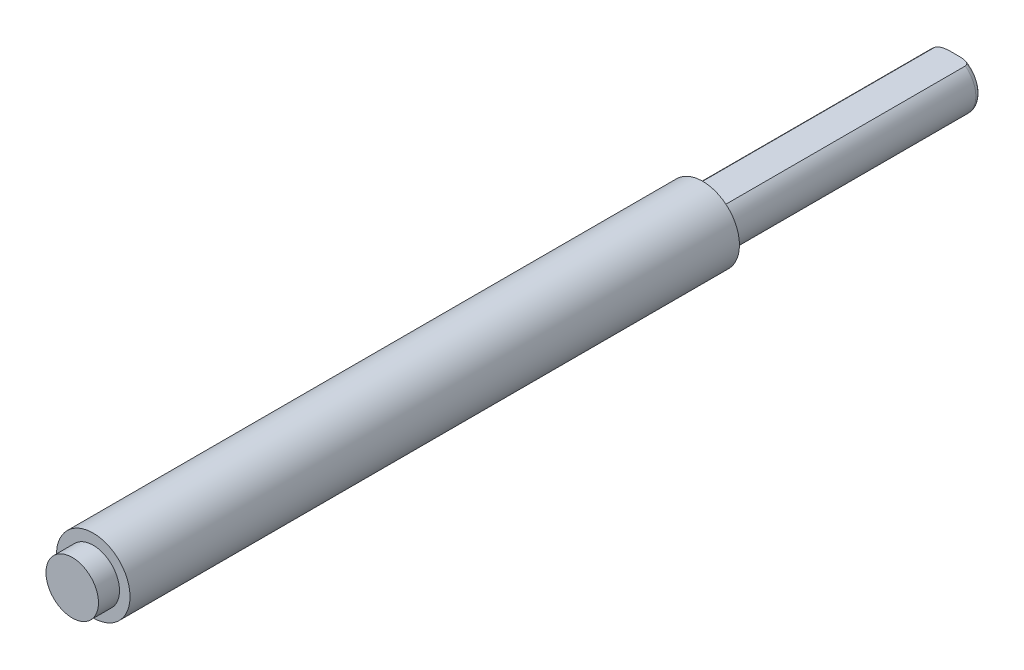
ISO-10303-21;
HEADER;
FILE_DESCRIPTION(('STEP AP214'),'2;1');
FILE_NAME('part.step','',(''),(''),'','','');
FILE_SCHEMA(('AUTOMOTIVE_DESIGN { 1 0 10303 214 1 1 1 1 }'));
ENDSEC;
DATA;
#1=APPLICATION_CONTEXT('core data for automotive mechanical design processes');
#2=APPLICATION_PROTOCOL_DEFINITION('international standard','automotive_design',2000,#1);
#3=PRODUCT_CONTEXT('',#1,'mechanical');
#4=PRODUCT('Part','Part','',(#3));
#5=PRODUCT_RELATED_PRODUCT_CATEGORY('part','',(#4));
#6=PRODUCT_DEFINITION_FORMATION('','',#4);
#7=PRODUCT_DEFINITION_CONTEXT('part definition',#1,'design');
#8=PRODUCT_DEFINITION('design','',#6,#7);
#9=PRODUCT_DEFINITION_SHAPE('','',#8);
#10=(LENGTH_UNIT() NAMED_UNIT(*) SI_UNIT(.MILLI.,.METRE.));
#11=(NAMED_UNIT(*) PLANE_ANGLE_UNIT() SI_UNIT($,.RADIAN.));
#12=(NAMED_UNIT(*) SI_UNIT($,.STERADIAN.) SOLID_ANGLE_UNIT());
#13=UNCERTAINTY_MEASURE_WITH_UNIT(LENGTH_MEASURE(1.E-05),#10,'distance_accuracy_value','');
#14=(GEOMETRIC_REPRESENTATION_CONTEXT(3) GLOBAL_UNCERTAINTY_ASSIGNED_CONTEXT((#13)) GLOBAL_UNIT_ASSIGNED_CONTEXT((#10,
#11,#12)) REPRESENTATION_CONTEXT('',''));
#15=CARTESIAN_POINT('',(0.,0.,0.));
#16=DIRECTION('',(0.,0.,1.));
#17=DIRECTION('',(1.,0.,0.));
#18=AXIS2_PLACEMENT_3D('',#15,#16,#17);
#19=CARTESIAN_POINT('',(0.,0.,82.));
#20=DIRECTION('',(0.,0.,1.));
#21=DIRECTION('',(1.,0.,0.));
#22=AXIS2_PLACEMENT_3D('',#19,#20,#21);
#23=PLANE('',#22);
#24=CARTESIAN_POINT('',(0.,0.,82.));
#25=DIRECTION('',(0.,0.,1.));
#26=DIRECTION('',(1.,0.,0.));
#27=AXIS2_PLACEMENT_3D('',#24,#25,#26);
#28=CIRCLE('',#27,3.5);
#29=CARTESIAN_POINT('',(3.5,0.,82.));
#30=VERTEX_POINT('',#29);
#31=EDGE_CURVE('E94',#30,#30,#28,.T.);
#32=ORIENTED_EDGE('',*,*,#31,.T.);
#33=EDGE_LOOP('',(#32));
#34=FACE_BOUND('',#33,.T.);
#35=CARTESIAN_POINT('',(0.,0.,82.));
#36=DIRECTION('',(0.,0.,1.));
#37=DIRECTION('',(1.,0.,0.));
#38=AXIS2_PLACEMENT_3D('',#35,#36,#37);
#39=CIRCLE('',#38,2.5);
#40=CARTESIAN_POINT('',(2.5,0.,82.));
#41=VERTEX_POINT('',#40);
#42=EDGE_CURVE('E158',#41,#41,#39,.T.);
#43=ORIENTED_EDGE('',*,*,#42,.F.);
#44=EDGE_LOOP('',(#43));
#45=FACE_BOUND('',#44,.T.);
#46=ADVANCED_FACE('F33',(#34,#45),#23,.T.);
#47=CARTESIAN_POINT('',(0.,0.,34.));
#48=DIRECTION('',(0.,0.,-1.));
#49=DIRECTION('',(-1.,0.,0.));
#50=AXIS2_PLACEMENT_3D('',#47,#48,#49);
#51=CYLINDRICAL_SURFACE('',#50,2.5);
#52=DIRECTION('',(0.,0.,-1.));
#53=VECTOR('',#52,1.);
#54=CARTESIAN_POINT('',(-1.5,2.,34.));
#55=LINE('',#54,#53);
#56=CARTESIAN_POINT('',(-1.5,2.,24.));
#57=VERTEX_POINT('',#56);
#58=CARTESIAN_POINT('',(-1.5,2.,0.5));
#59=VERTEX_POINT('',#58);
#60=EDGE_CURVE('E80',#57,#59,#55,.T.);
#61=ORIENTED_EDGE('',*,*,#60,.T.);
#62=CARTESIAN_POINT('',(0.,0.,0.5));
#63=DIRECTION('',(0.,0.,1.));
#64=DIRECTION('',(1.,0.,0.));
#65=AXIS2_PLACEMENT_3D('',#62,#63,#64);
#66=CIRCLE('',#65,2.5);
#67=CARTESIAN_POINT('',(1.5,2.,0.5));
#68=VERTEX_POINT('',#67);
#69=EDGE_CURVE('E103',#59,#68,#66,.T.);
#70=ORIENTED_EDGE('',*,*,#69,.T.);
#71=DIRECTION('',(0.,0.,-1.));
#72=VECTOR('',#71,1.);
#73=CARTESIAN_POINT('',(1.5,2.,34.));
#74=LINE('',#73,#72);
#75=CARTESIAN_POINT('',(1.5,2.,24.));
#76=VERTEX_POINT('',#75);
#77=EDGE_CURVE('E81',#76,#68,#74,.T.);
#78=ORIENTED_EDGE('',*,*,#77,.F.);
#79=CARTESIAN_POINT('',(0.,0.,24.));
#80=DIRECTION('',(0.,0.,1.));
#81=DIRECTION('',(1.,0.,0.));
#82=AXIS2_PLACEMENT_3D('',#79,#80,#81);
#83=CIRCLE('',#82,2.5);
#84=EDGE_CURVE('E101',#57,#76,#83,.T.);
#85=ORIENTED_EDGE('',*,*,#84,.F.);
#86=EDGE_LOOP('',(#61,#70,#78,#85));
#87=FACE_BOUND('',#86,.T.);
#88=ADVANCED_FACE('F124',(#87),#51,.T.);
#89=CARTESIAN_POINT('',(0.,0.,0.));
#90=DIRECTION('',(0.,0.,1.));
#91=DIRECTION('',(1.,0.,0.));
#92=AXIS2_PLACEMENT_3D('',#89,#90,#91);
#93=PLANE('',#92);
#94=CARTESIAN_POINT('',(0.,0.,0.));
#95=DIRECTION('',(0.,0.,1.));
#96=DIRECTION('',(1.,0.,0.));
#97=AXIS2_PLACEMENT_3D('',#94,#95,#96);
#98=CIRCLE('',#97,2.);
#99=CARTESIAN_POINT('',(0.,2.,0.));
#100=VERTEX_POINT('',#99);
#101=EDGE_CURVE('E11',#100,#100,#98,.F.);
#102=ORIENTED_EDGE('',*,*,#101,.T.);
#103=EDGE_LOOP('',(#102));
#104=FACE_BOUND('',#103,.T.);
#105=ADVANCED_FACE('F129',(#104),#93,.F.);
#106=CARTESIAN_POINT('',(0.,0.,24.));
#107=DIRECTION('',(0.,0.,1.));
#108=DIRECTION('',(1.,0.,0.));
#109=AXIS2_PLACEMENT_3D('',#106,#107,#108);
#110=PLANE('',#109);
#111=CARTESIAN_POINT('',(0.,0.,24.));
#112=DIRECTION('',(0.,0.,1.));
#113=DIRECTION('',(1.,0.,0.));
#114=AXIS2_PLACEMENT_3D('',#111,#112,#113);
#115=CIRCLE('',#114,3.5);
#116=CARTESIAN_POINT('',(3.5,0.,24.));
#117=VERTEX_POINT('',#116);
#118=EDGE_CURVE('E98',#117,#117,#115,.T.);
#119=ORIENTED_EDGE('',*,*,#118,.F.);
#120=EDGE_LOOP('',(#119));
#121=FACE_BOUND('',#120,.T.);
#122=EDGE_CURVE('E75',#76,#57,#83,.T.);
#123=ORIENTED_EDGE('',*,*,#122,.T.);
#124=ORIENTED_EDGE('',*,*,#84,.T.);
#125=EDGE_LOOP('',(#123,#124));
#126=FACE_BOUND('',#125,.T.);
#127=ADVANCED_FACE('F126',(#121,#126),#110,.F.);
#128=CARTESIAN_POINT('',(0.,0.,24.));
#129=DIRECTION('',(0.,0.,1.));
#130=DIRECTION('',(1.,0.,0.));
#131=AXIS2_PLACEMENT_3D('',#128,#129,#130);
#132=CYLINDRICAL_SURFACE('',#131,3.5);
#133=ORIENTED_EDGE('',*,*,#118,.T.);
#134=EDGE_LOOP('',(#133));
#135=FACE_BOUND('',#134,.T.);
#136=ORIENTED_EDGE('',*,*,#31,.F.);
#137=EDGE_LOOP('',(#136));
#138=FACE_BOUND('',#137,.T.);
#139=ADVANCED_FACE('F121',(#135,#138),#132,.T.);
#140=CARTESIAN_POINT('',(0.,0.,34.));
#141=DIRECTION('',(0.,0.,-1.));
#142=DIRECTION('',(-1.,0.,0.));
#143=AXIS2_PLACEMENT_3D('',#140,#141,#142);
#144=CYLINDRICAL_SURFACE('',#143,2.5);
#145=CARTESIAN_POINT('',(1.5,2.,34.));
#146=VERTEX_POINT('',#145);
#147=EDGE_CURVE('E69',#146,#76,#74,.T.);
#148=ORIENTED_EDGE('',*,*,#147,.F.);
#149=CARTESIAN_POINT('',(0.,0.,34.));
#150=DIRECTION('',(0.,0.,-1.));
#151=DIRECTION('',(-1.,0.,0.));
#152=AXIS2_PLACEMENT_3D('',#149,#150,#151);
#153=CIRCLE('',#152,2.5);
#154=CARTESIAN_POINT('',(-1.5,2.,34.));
#155=VERTEX_POINT('',#154);
#156=EDGE_CURVE('E72',#155,#146,#153,.T.);
#157=ORIENTED_EDGE('',*,*,#156,.F.);
#158=EDGE_CURVE('E90',#155,#57,#55,.T.);
#159=ORIENTED_EDGE('',*,*,#158,.T.);
#160=ORIENTED_EDGE('',*,*,#122,.F.);
#161=EDGE_LOOP('',(#148,#157,#159,#160));
#162=FACE_BOUND('',#161,.T.);
#163=ADVANCED_FACE('F71',(#162),#144,.F.);
#164=CARTESIAN_POINT('',(1.5,2.,34.));
#165=DIRECTION('',(0.,-1.,0.));
#166=DIRECTION('',(0.,0.,-1.));
#167=AXIS2_PLACEMENT_3D('',#164,#165,#166);
#168=PLANE('',#167);
#169=ORIENTED_EDGE('',*,*,#77,.T.);
#170=CARTESIAN_POINT('',(1.5,2.,0.5));
#171=CARTESIAN_POINT('',(1.50005508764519,2.,0.479993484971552));
#172=CARTESIAN_POINT('',(1.49800297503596,2.,0.460049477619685));
#173=CARTESIAN_POINT('',(1.49017103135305,2.,0.421109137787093));
#174=CARTESIAN_POINT('',(1.48442943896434,2.,0.402105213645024));
#175=CARTESIAN_POINT('',(1.46971395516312,2.,0.36549928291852));
#176=CARTESIAN_POINT('',(1.46075157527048,2.,0.347892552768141));
#177=CARTESIAN_POINT('',(1.44018960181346,2.,0.314258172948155));
#178=CARTESIAN_POINT('',(1.42858295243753,2.,0.298234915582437));
#179=CARTESIAN_POINT('',(1.39760924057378,2.,0.261066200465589));
#180=CARTESIAN_POINT('',(1.37710380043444,2.,0.240872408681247));
#181=CARTESIAN_POINT('',(1.3332153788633,2.,0.20398062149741));
#182=CARTESIAN_POINT('',(1.30982929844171,2.,0.187286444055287));
#183=CARTESIAN_POINT('',(1.24588475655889,2.,0.147473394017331));
#184=CARTESIAN_POINT('',(1.20375339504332,2.,0.126889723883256));
#185=CARTESIAN_POINT('',(1.13857481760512,2.,0.100734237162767));
#186=CARTESIAN_POINT('',(1.11639476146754,2.,0.092772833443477));
#187=CARTESIAN_POINT('',(1.07158652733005,2.,0.0782652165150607));
#188=CARTESIAN_POINT('',(1.04895868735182,2.,0.071717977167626));
#189=CARTESIAN_POINT('',(0.982989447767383,2.,0.0545224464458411));
#190=CARTESIAN_POINT('',(0.939240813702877,2.,0.0454505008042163));
#191=CARTESIAN_POINT('',(0.851180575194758,2.,0.0305610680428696));
#192=CARTESIAN_POINT('',(0.806868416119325,2.,0.0247470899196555));
#193=CARTESIAN_POINT('',(0.717748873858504,2.,0.0154595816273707));
#194=CARTESIAN_POINT('',(0.672940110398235,2.,0.0119999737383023));
#195=CARTESIAN_POINT('',(0.583224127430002,2.,0.00672393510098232));
#196=CARTESIAN_POINT('',(0.538316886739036,2.,0.0049079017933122));
#197=CARTESIAN_POINT('',(0.452027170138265,2.,0.00241155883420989));
#198=CARTESIAN_POINT('',(0.410646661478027,2.,0.00165282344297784));
#199=CARTESIAN_POINT('',(0.327877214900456,2.,0.000635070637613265));
#200=CARTESIAN_POINT('',(0.286488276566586,2.,0.000376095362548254));
#201=CARTESIAN_POINT('',(0.204245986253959,2.,7.37240462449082E-05));
#202=CARTESIAN_POINT('',(0.163392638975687,2.,2.7579873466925E-05));
#203=CARTESIAN_POINT('',(0.0816928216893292,2.,5.54583589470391E-07));
#204=CARTESIAN_POINT('',(0.0408463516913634,2.,1.96623861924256E-05));
#205=CARTESIAN_POINT('',(0.,2.,0.));
#206=B_SPLINE_CURVE_WITH_KNOTS('',3,(#170,#171,#172,#173,#174,#175,#176,#177,#178,#179,#180,
#181,#182,#183,#184,#185,#186,#187,#188,#189,#190,#191,#192,#193,#194,#195,#196,#197,#198,#199,
#200,#201,#202,#203,#204,#205),.UNSPECIFIED.,.F.,.F.,(4,2,2,2,2,2,2,2,2,2,2,2,2,2,2,2,2,4),(0.,
0.0598154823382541,0.119020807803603,0.178016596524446,0.237171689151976,0.32302240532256,
0.4089662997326,0.548800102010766,0.619474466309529,0.690097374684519,0.823948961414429,
0.957944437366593,1.09272554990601,1.2275392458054,1.35169671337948,1.47586464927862,
1.59842472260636,1.72096398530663),.UNSPECIFIED.);
#207=EDGE_CURVE('E42',#68,#100,#206,.T.);
#208=ORIENTED_EDGE('',*,*,#207,.T.);
#209=CARTESIAN_POINT('',(0.,2.,0.));
#210=CARTESIAN_POINT('',(-0.0407626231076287,2.,1.95157159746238E-05));
#211=CARTESIAN_POINT('',(-0.0815253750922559,2.,5.56610073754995E-07));
#212=CARTESIAN_POINT('',(-0.16305752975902,2.,2.73480300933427E-05));
#213=CARTESIAN_POINT('',(-0.203826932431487,2.,7.31092075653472E-05));
#214=CARTESIAN_POINT('',(-0.285823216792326,2.,0.000372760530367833));
#215=CARTESIAN_POINT('',(-0.327050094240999,2.,0.000628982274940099));
#216=CARTESIAN_POINT('',(-0.409495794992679,2.,0.00163467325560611));
#217=CARTESIAN_POINT('',(-0.450714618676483,2.,0.00238410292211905));
#218=CARTESIAN_POINT('',(-0.534687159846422,2.,0.00479235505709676));
#219=CARTESIAN_POINT('',(-0.577440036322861,2.,0.00648446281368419));
#220=CARTESIAN_POINT('',(-0.662861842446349,2.,0.0113237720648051));
#221=CARTESIAN_POINT('',(-0.705530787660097,2.,0.0144706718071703));
#222=CARTESIAN_POINT('',(-0.790467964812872,2.,0.0228370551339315));
#223=CARTESIAN_POINT('',(-0.832737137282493,2.,0.0280465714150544));
#224=CARTESIAN_POINT('',(-0.916821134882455,2.,0.0412934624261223));
#225=CARTESIAN_POINT('',(-0.958636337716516,2.,0.0493282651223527));
#226=CARTESIAN_POINT('',(-1.01633423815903,2.,0.063150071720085));
#227=CARTESIAN_POINT('',(-1.0325980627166,2.,0.0673552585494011));
#228=CARTESIAN_POINT('',(-1.06494846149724,2.,0.0764196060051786));
#229=CARTESIAN_POINT('',(-1.08103496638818,2.,0.0812790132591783));
#230=CARTESIAN_POINT('',(-1.12889043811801,2.,0.0969233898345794));
#231=CARTESIAN_POINT('',(-1.16032087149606,2.,0.108789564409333));
#232=CARTESIAN_POINT('',(-1.22193787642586,2.,0.136152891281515));
#233=CARTESIAN_POINT('',(-1.25211017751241,2.,0.151682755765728));
#234=CARTESIAN_POINT('',(-1.30987180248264,2.,0.187028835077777));
#235=CARTESIAN_POINT('',(-1.33746517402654,2.,0.206838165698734));
#236=CARTESIAN_POINT('',(-1.37963467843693,2.,0.243677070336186));
#237=CARTESIAN_POINT('',(-1.39542133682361,2.,0.259314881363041));
#238=CARTESIAN_POINT('',(-1.4245077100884,2.,0.292773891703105));
#239=CARTESIAN_POINT('',(-1.43780974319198,2.,0.310593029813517));
#240=CARTESIAN_POINT('',(-1.45935751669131,2.,0.345436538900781));
#241=CARTESIAN_POINT('',(-1.46806350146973,2.,0.362174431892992));
#242=CARTESIAN_POINT('',(-1.48256312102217,2.,0.396856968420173));
#243=CARTESIAN_POINT('',(-1.48836281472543,2.,0.41479901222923));
#244=CARTESIAN_POINT('',(-1.49497096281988,2.,0.444066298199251));
#245=CARTESIAN_POINT('',(-1.49684839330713,2.,0.455157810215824));
#246=CARTESIAN_POINT('',(-1.49936626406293,2.,0.477496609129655));
#247=CARTESIAN_POINT('',(-1.5000048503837,2.,0.488744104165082));
#248=CARTESIAN_POINT('',(-1.5,2.,0.500000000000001));
#249=B_SPLINE_CURVE_WITH_KNOTS('',3,(#209,#210,#211,#212,#213,#214,#215,#216,#217,#218,#219,
#220,#221,#222,#223,#224,#225,#226,#227,#228,#229,#230,#231,#232,#233,#234,#235,#236,#237,#238,
#239,#240,#241,#242,#243,#244,#245,#246,#247,#248),.UNSPECIFIED.,.F.,.F.,(4,2,2,2,2,2,2,2,2,2,2,
2,2,2,2,2,2,2,2,4),(0.,0.122288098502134,0.244596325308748,0.368278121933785,0.491949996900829,
0.620293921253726,0.748611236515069,0.876315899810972,1.00390460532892,1.05428854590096,
1.10469153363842,1.20529649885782,1.30683621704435,1.4082137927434,1.47468160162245,
1.54108708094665,1.5974625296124,1.65371995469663,1.68740390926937,1.72113823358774),.UNSPECIFIED.);
#250=EDGE_CURVE('E105',#100,#59,#249,.T.);
#251=ORIENTED_EDGE('',*,*,#250,.T.);
#252=ORIENTED_EDGE('',*,*,#60,.F.);
#253=ORIENTED_EDGE('',*,*,#158,.F.);
#254=DIRECTION('',(-1.,0.,0.));
#255=VECTOR('',#254,1.);
#256=CARTESIAN_POINT('',(1.5,2.,34.));
#257=LINE('',#256,#255);
#258=EDGE_CURVE('E85',#146,#155,#257,.T.);
#259=ORIENTED_EDGE('',*,*,#258,.F.);
#260=ORIENTED_EDGE('',*,*,#147,.T.);
#261=EDGE_LOOP('',(#169,#208,#251,#252,#253,#259,#260));
#262=FACE_BOUND('',#261,.T.);
#263=ADVANCED_FACE('F88',(#262),#168,.F.);
#264=CARTESIAN_POINT('',(0.,0.,34.));
#265=DIRECTION('',(0.,0.,-1.));
#266=DIRECTION('',(-1.,0.,0.));
#267=AXIS2_PLACEMENT_3D('',#264,#265,#266);
#268=PLANE('',#267);
#269=ORIENTED_EDGE('',*,*,#156,.T.);
#270=ORIENTED_EDGE('',*,*,#258,.T.);
#271=EDGE_LOOP('',(#269,#270));
#272=FACE_BOUND('',#271,.T.);
#273=ADVANCED_FACE('F84',(#272),#268,.T.);
#274=CARTESIAN_POINT('',(0.,0.,84.));
#275=DIRECTION('',(0.,0.,-1.));
#276=DIRECTION('',(-1.,0.,0.));
#277=AXIS2_PLACEMENT_3D('',#274,#275,#276);
#278=CYLINDRICAL_SURFACE('',#277,2.5);
#279=CARTESIAN_POINT('',(0.,0.,84.));
#280=DIRECTION('',(0.,0.,1.));
#281=DIRECTION('',(1.,0.,0.));
#282=AXIS2_PLACEMENT_3D('',#279,#280,#281);
#283=CIRCLE('',#282,2.5);
#284=CARTESIAN_POINT('',(2.5,0.,84.));
#285=VERTEX_POINT('',#284);
#286=EDGE_CURVE('E86',#285,#285,#283,.T.);
#287=ORIENTED_EDGE('',*,*,#286,.F.);
#288=EDGE_LOOP('',(#287));
#289=FACE_BOUND('',#288,.T.);
#290=ORIENTED_EDGE('',*,*,#42,.T.);
#291=EDGE_LOOP('',(#290));
#292=FACE_BOUND('',#291,.T.);
#293=ADVANCED_FACE('F149',(#289,#292),#278,.T.);
#294=CARTESIAN_POINT('',(0.,0.,84.));
#295=DIRECTION('',(0.,0.,1.));
#296=DIRECTION('',(1.,0.,0.));
#297=AXIS2_PLACEMENT_3D('',#294,#295,#296);
#298=PLANE('',#297);
#299=ORIENTED_EDGE('',*,*,#286,.T.);
#300=EDGE_LOOP('',(#299));
#301=FACE_BOUND('',#300,.T.);
#302=ADVANCED_FACE('F145',(#301),#298,.T.);
#303=CARTESIAN_POINT('',(0.,0.,0.5));
#304=DIRECTION('',(0.,0.,1.));
#305=DIRECTION('',(1.,0.,0.));
#306=AXIS2_PLACEMENT_3D('',#303,#304,#305);
#307=TOROIDAL_SURFACE('',#306,2.,0.5);
#308=ORIENTED_EDGE('',*,*,#250,.F.);
#309=ORIENTED_EDGE('',*,*,#101,.F.);
#310=ORIENTED_EDGE('',*,*,#207,.F.);
#311=ORIENTED_EDGE('',*,*,#69,.F.);
#312=EDGE_LOOP('',(#308,#309,#310,#311));
#313=FACE_BOUND('',#312,.T.);
#314=ADVANCED_FACE('F35',(#313),#307,.T.);
#315=CLOSED_SHELL('',(#46,#88,#105,#127,#139,#163,#263,#273,#293,#302,#314));
#316=MANIFOLD_SOLID_BREP('B2',#315);
#317=ADVANCED_BREP_SHAPE_REPRESENTATION('',(#18,#316),#14);
#318=SHAPE_DEFINITION_REPRESENTATION(#9,#317);
ENDSEC;
END-ISO-10303-21;
